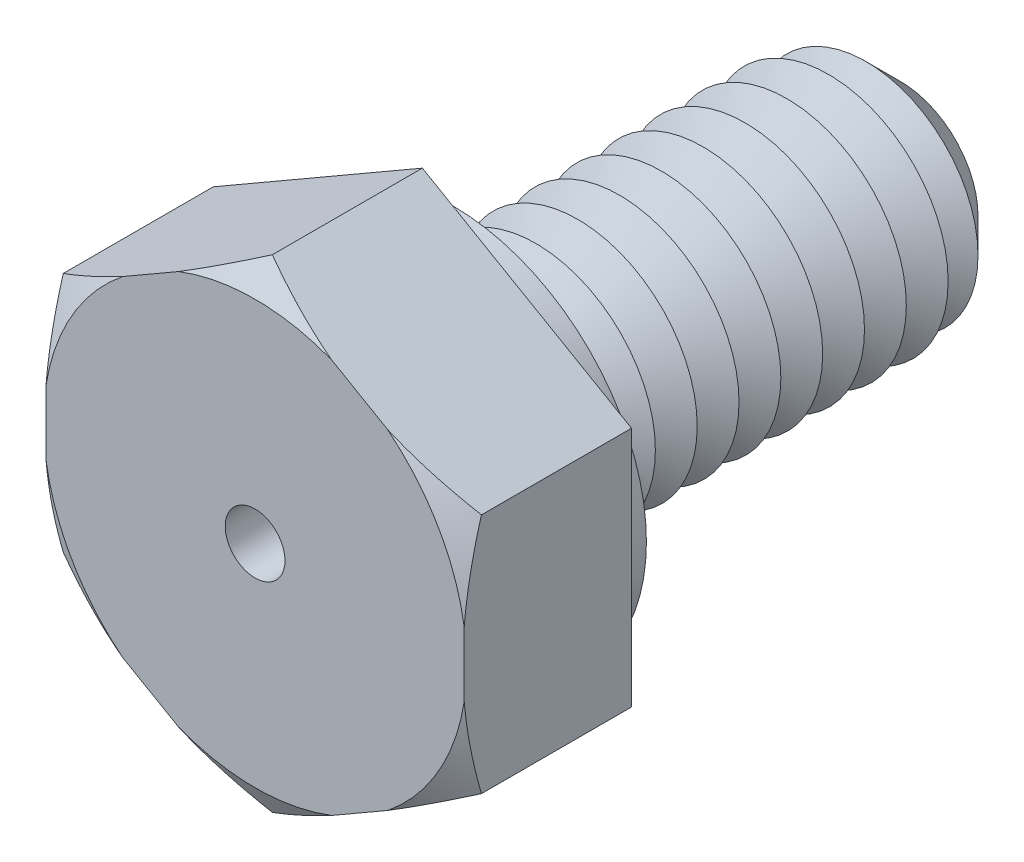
ISO-10303-21;
HEADER;
FILE_DESCRIPTION(('STEP AP214'),'2;1');
FILE_NAME('part.step','',(''),(''),'','','');
FILE_SCHEMA(('AUTOMOTIVE_DESIGN { 1 0 10303 214 1 1 1 1 }'));
ENDSEC;
DATA;
#1=APPLICATION_CONTEXT('core data for automotive mechanical design processes');
#2=APPLICATION_PROTOCOL_DEFINITION('international standard','automotive_design',2000,#1);
#3=PRODUCT_CONTEXT('',#1,'mechanical');
#4=PRODUCT('Part','Part','',(#3));
#5=PRODUCT_RELATED_PRODUCT_CATEGORY('part','',(#4));
#6=PRODUCT_DEFINITION_FORMATION('','',#4);
#7=PRODUCT_DEFINITION_CONTEXT('part definition',#1,'design');
#8=PRODUCT_DEFINITION('design','',#6,#7);
#9=PRODUCT_DEFINITION_SHAPE('','',#8);
#10=(LENGTH_UNIT() NAMED_UNIT(*) SI_UNIT(.MILLI.,.METRE.));
#11=(NAMED_UNIT(*) PLANE_ANGLE_UNIT() SI_UNIT($,.RADIAN.));
#12=(NAMED_UNIT(*) SI_UNIT($,.STERADIAN.) SOLID_ANGLE_UNIT());
#13=UNCERTAINTY_MEASURE_WITH_UNIT(LENGTH_MEASURE(1.E-05),#10,'distance_accuracy_value','');
#14=(GEOMETRIC_REPRESENTATION_CONTEXT(3) GLOBAL_UNCERTAINTY_ASSIGNED_CONTEXT((#13)) GLOBAL_UNIT_ASSIGNED_CONTEXT((#10,
#11,#12)) REPRESENTATION_CONTEXT('',''));
#15=CARTESIAN_POINT('',(0.,0.,0.));
#16=DIRECTION('',(0.,0.,1.));
#17=DIRECTION('',(1.,0.,0.));
#18=AXIS2_PLACEMENT_3D('',#15,#16,#17);
#19=CARTESIAN_POINT('',(3.5,2.02072594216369,2.8));
#20=DIRECTION('',(-0.5,-0.866025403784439,0.));
#21=DIRECTION('',(0.866025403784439,-0.5,0.));
#22=AXIS2_PLACEMENT_3D('',#19,#20,#21);
#23=PLANE('',#22);
#24=CARTESIAN_POINT('',(5.93124915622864,0.617043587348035,1.40176894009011));
#25=CARTESIAN_POINT('',(5.82127624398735,0.680536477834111,1.46111507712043));
#26=CARTESIAN_POINT('',(5.71104026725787,0.744181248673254,1.51982121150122));
#27=CARTESIAN_POINT('',(5.48993126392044,0.871838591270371,1.63565294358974));
#28=CARTESIAN_POINT('',(5.37905815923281,0.935851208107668,1.69277834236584));
#29=CARTESIAN_POINT('',(5.15623473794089,1.06449837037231,1.80531321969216));
#30=CARTESIAN_POINT('',(5.04428210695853,1.12913425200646,1.86071660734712));
#31=CARTESIAN_POINT('',(4.81953834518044,1.25889012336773,1.96920237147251));
#32=CARTESIAN_POINT('',(4.70674724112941,1.32401009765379,2.02228482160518));
#33=CARTESIAN_POINT('',(4.4773029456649,1.45647982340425,2.12693843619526));
#34=CARTESIAN_POINT('',(4.3606246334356,1.52384407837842,2.17843650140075));
#35=CARTESIAN_POINT('',(4.12610336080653,1.65924499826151,2.27776074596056));
#36=CARTESIAN_POINT('',(4.00826046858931,1.72728162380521,2.32558713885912));
#37=CARTESIAN_POINT('',(3.77136592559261,1.86405275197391,2.41666718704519));
#38=CARTESIAN_POINT('',(3.65231548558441,1.93278655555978,2.45992500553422));
#39=CARTESIAN_POINT('',(3.41281068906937,2.07106471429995,2.54086522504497));
#40=CARTESIAN_POINT('',(3.29235651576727,2.14060896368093,2.57854834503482));
#41=CARTESIAN_POINT('',(3.00433211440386,2.30689992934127,2.66006219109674));
#42=CARTESIAN_POINT('',(2.83610127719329,2.40402804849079,2.70086381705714));
#43=CARTESIAN_POINT('',(2.49725085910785,2.59966342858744,2.76622673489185));
#44=CARTESIAN_POINT('',(2.32663213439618,2.69817019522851,2.79079370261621));
#45=CARTESIAN_POINT('',(2.07079150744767,2.84587985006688,2.81342200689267));
#46=CARTESIAN_POINT('',(1.98601608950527,2.89482496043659,2.8186046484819));
#47=CARTESIAN_POINT('',(1.81634230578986,2.9927861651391,2.82423615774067));
#48=CARTESIAN_POINT('',(1.73144394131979,3.04180225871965,2.82468507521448));
#49=CARTESIAN_POINT('',(1.56172682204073,3.13978848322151,2.82082792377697));
#50=CARTESIAN_POINT('',(1.47690807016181,3.18875861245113,2.81652168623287));
#51=CARTESIAN_POINT('',(1.30753953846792,3.28654357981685,2.80328667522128));
#52=CARTESIAN_POINT('',(1.22298977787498,3.3353584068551,2.79435757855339));
#53=CARTESIAN_POINT('',(1.02330750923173,3.45064501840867,2.76803629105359));
#54=CARTESIAN_POINT('',(0.90836188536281,3.51700890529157,2.7487394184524));
#55=CARTESIAN_POINT('',(0.679569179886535,3.64910243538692,2.70286231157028));
#56=CARTESIAN_POINT('',(0.565722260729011,3.71483198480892,2.67628101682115));
#57=CARTESIAN_POINT('',(0.339141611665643,3.84564838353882,2.61683846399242));
#58=CARTESIAN_POINT('',(0.226409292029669,3.91073441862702,2.58397011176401));
#59=CARTESIAN_POINT('',(0.00220965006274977,4.04017614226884,2.512988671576));
#60=CARTESIAN_POINT('',(-0.109257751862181,4.10453187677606,2.47487591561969));
#61=CARTESIAN_POINT('',(-0.332327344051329,4.23332116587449,2.39383232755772));
#62=CARTESIAN_POINT('',(-0.443915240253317,4.29774646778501,2.35084938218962));
#63=CARTESIAN_POINT('',(-0.665905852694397,4.42591280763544,2.26126522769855));
#64=CARTESIAN_POINT('',(-0.776309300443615,4.48965426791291,2.2146664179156));
#65=CARTESIAN_POINT('',(-1.10600622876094,4.68000487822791,2.07044134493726));
#66=CARTESIAN_POINT('',(-1.32384189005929,4.80577235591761,1.96836549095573));
#67=CARTESIAN_POINT('',(-1.61545494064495,4.97413522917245,1.82536950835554));
#68=CARTESIAN_POINT('',(-1.69056073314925,5.01749757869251,1.78796601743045));
#69=CARTESIAN_POINT('',(-1.84044297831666,5.10403213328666,1.71229146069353));
#70=CARTESIAN_POINT('',(-1.91521944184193,5.14720434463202,1.67402042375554));
#71=CARTESIAN_POINT('',(-2.06368614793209,5.23292163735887,1.59712633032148));
#72=CARTESIAN_POINT('',(-2.13737951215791,5.27546852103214,1.55851128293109));
#73=CARTESIAN_POINT('',(-2.28450431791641,5.36041106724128,1.48061736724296));
#74=CARTESIAN_POINT('',(-2.35793575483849,5.40280672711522,1.44133848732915));
#75=CARTESIAN_POINT('',(-2.43124915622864,5.44513423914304,1.40176894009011));
#76=B_SPLINE_CURVE_WITH_KNOTS('',3,(#24,#25,#26,#27,#28,#29,#30,#31,#32,#33,#34,#35,#36,#37,#38,
#39,#40,#41,#42,#43,#44,#45,#46,#47,#48,#49,#50,#51,#52,#53,#54,#55,#56,#57,#58,#59,#60,#61,#62,
#63,#64,#65,#66,#67,#68,#69,#70,#71,#72,#73,#74,#75),.UNSPECIFIED.,.F.,.F.,(4,2,2,2,2,2,2,2,2,2,
2,2,2,2,2,2,2,2,2,2,2,2,2,2,2,4),(0.,0.420511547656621,0.841075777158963,1.26298883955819,
1.68488850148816,2.11755106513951,2.55018844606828,2.98242811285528,3.41461198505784,
4.0095520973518,4.60428410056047,4.89826759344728,5.19224799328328,5.48623881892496,
5.78025020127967,6.1823765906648,6.58456155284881,6.98720303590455,7.3898190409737,
7.7972442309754,8.20440134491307,9.01851321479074,9.30185450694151,9.58518638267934,
9.86552040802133,10.1458593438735),.UNSPECIFIED.);
#77=CARTESIAN_POINT('',(3.5,2.02072594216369,2.51132486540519));
#78=VERTEX_POINT('',#77);
#79=CARTESIAN_POINT('',(2.2178793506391,2.76095864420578,2.8));
#80=VERTEX_POINT('',#79);
#81=EDGE_CURVE('E132',#78,#80,#76,.T.);
#82=ORIENTED_EDGE('',*,*,#81,.F.);
#83=DIRECTION('',(0.,0.,-1.));
#84=VECTOR('',#83,1.);
#85=CARTESIAN_POINT('',(3.5,2.02072594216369,2.8));
#86=LINE('',#85,#84);
#87=CARTESIAN_POINT('',(3.5,2.02072594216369,0.));
#88=VERTEX_POINT('',#87);
#89=EDGE_CURVE('E144',#78,#88,#86,.T.);
#90=ORIENTED_EDGE('',*,*,#89,.T.);
#91=DIRECTION('',(-0.866025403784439,0.5,0.));
#92=VECTOR('',#91,1.);
#93=CARTESIAN_POINT('',(3.5,2.02072594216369,0.));
#94=LINE('',#93,#92);
#95=CARTESIAN_POINT('',(0.,4.04145188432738,0.));
#96=VERTEX_POINT('',#95);
#97=EDGE_CURVE('E281',#88,#96,#94,.T.);
#98=ORIENTED_EDGE('',*,*,#97,.T.);
#99=DIRECTION('',(0.,0.,-1.));
#100=VECTOR('',#99,1.);
#101=CARTESIAN_POINT('',(0.,4.04145188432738,2.8));
#102=LINE('',#101,#100);
#103=CARTESIAN_POINT('',(0.,4.04145188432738,2.51132486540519));
#104=VERTEX_POINT('',#103);
#105=EDGE_CURVE('E179',#104,#96,#102,.T.);
#106=ORIENTED_EDGE('',*,*,#105,.F.);
#107=CARTESIAN_POINT('',(1.2821206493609,3.30121918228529,2.8));
#108=VERTEX_POINT('',#107);
#109=EDGE_CURVE('E151',#108,#104,#76,.T.);
#110=ORIENTED_EDGE('',*,*,#109,.F.);
#111=DIRECTION('',(-0.866025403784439,0.5,0.));
#112=VECTOR('',#111,1.);
#113=CARTESIAN_POINT('',(3.5,2.02072594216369,2.8));
#114=LINE('',#113,#112);
#115=EDGE_CURVE('E148',#80,#108,#114,.T.);
#116=ORIENTED_EDGE('',*,*,#115,.F.);
#117=EDGE_LOOP('',(#82,#90,#98,#106,#110,#116));
#118=FACE_BOUND('',#117,.T.);
#119=ADVANCED_FACE('F39',(#118),#23,.F.);
#120=CARTESIAN_POINT('',(0.,4.04145188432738,2.8));
#121=DIRECTION('',(0.5,-0.866025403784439,0.));
#122=DIRECTION('',(0.866025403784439,0.5,0.));
#123=AXIS2_PLACEMENT_3D('',#120,#121,#122);
#124=PLANE('',#123);
#125=CARTESIAN_POINT('',(2.43124915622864,5.44513423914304,1.4017689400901));
#126=CARTESIAN_POINT('',(2.32127624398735,5.38164134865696,1.46111507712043));
#127=CARTESIAN_POINT('',(2.21104026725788,5.31799657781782,1.51982121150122));
#128=CARTESIAN_POINT('',(1.98993126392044,5.1903392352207,1.63565294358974));
#129=CARTESIAN_POINT('',(1.87905815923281,5.1263266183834,1.69277834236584));
#130=CARTESIAN_POINT('',(1.65623473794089,4.99767945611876,1.80531321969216));
#131=CARTESIAN_POINT('',(1.54428210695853,4.93304357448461,1.86071660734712));
#132=CARTESIAN_POINT('',(1.31953834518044,4.80328770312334,1.96920237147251));
#133=CARTESIAN_POINT('',(1.20674724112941,4.73816772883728,2.02228482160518));
#134=CARTESIAN_POINT('',(0.977302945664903,4.60569800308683,2.12693843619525));
#135=CARTESIAN_POINT('',(0.860624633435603,4.53833374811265,2.17843650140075));
#136=CARTESIAN_POINT('',(0.626103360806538,4.40293282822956,2.27776074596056));
#137=CARTESIAN_POINT('',(0.50826046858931,4.33489620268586,2.32558713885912));
#138=CARTESIAN_POINT('',(0.271365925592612,4.19812507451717,2.41666718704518));
#139=CARTESIAN_POINT('',(0.152315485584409,4.12939127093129,2.45992500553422));
#140=CARTESIAN_POINT('',(-0.0871893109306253,3.99111311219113,2.54086522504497));
#141=CARTESIAN_POINT('',(-0.207643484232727,3.92156886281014,2.57854834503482));
#142=CARTESIAN_POINT('',(-0.495667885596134,3.7552778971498,2.66006219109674));
#143=CARTESIAN_POINT('',(-0.663898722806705,3.65814977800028,2.70086381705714));
#144=CARTESIAN_POINT('',(-1.00274914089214,3.46251439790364,2.76622673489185));
#145=CARTESIAN_POINT('',(-1.17336786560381,3.36400763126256,2.79079370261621));
#146=CARTESIAN_POINT('',(-1.42920849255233,3.21629797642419,2.81342200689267));
#147=CARTESIAN_POINT('',(-1.51398391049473,3.16735286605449,2.8186046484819));
#148=CARTESIAN_POINT('',(-1.68365769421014,3.06939166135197,2.82423615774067));
#149=CARTESIAN_POINT('',(-1.7685560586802,3.02037556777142,2.82468507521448));
#150=CARTESIAN_POINT('',(-1.93827317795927,2.92238934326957,2.82082792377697));
#151=CARTESIAN_POINT('',(-2.02309192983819,2.87341921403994,2.81652168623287));
#152=CARTESIAN_POINT('',(-2.19246046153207,2.77563424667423,2.80328667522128));
#153=CARTESIAN_POINT('',(-2.27701022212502,2.72681941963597,2.79435757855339));
#154=CARTESIAN_POINT('',(-2.47669249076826,2.6115328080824,2.76803629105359));
#155=CARTESIAN_POINT('',(-2.59163811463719,2.54516892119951,2.7487394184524));
#156=CARTESIAN_POINT('',(-2.82043082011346,2.41307539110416,2.70286231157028));
#157=CARTESIAN_POINT('',(-2.93427773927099,2.34734584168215,2.67628101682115));
#158=CARTESIAN_POINT('',(-3.16085838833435,2.21652944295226,2.61683846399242));
#159=CARTESIAN_POINT('',(-3.27359070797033,2.15144340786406,2.58397011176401));
#160=CARTESIAN_POINT('',(-3.49779034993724,2.02200168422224,2.512988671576));
#161=CARTESIAN_POINT('',(-3.60925775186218,1.95764594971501,2.47487591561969));
#162=CARTESIAN_POINT('',(-3.83232734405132,1.82885666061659,2.39383232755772));
#163=CARTESIAN_POINT('',(-3.94391524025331,1.76443135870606,2.35084938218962));
#164=CARTESIAN_POINT('',(-4.16590585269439,1.63626501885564,2.26126522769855));
#165=CARTESIAN_POINT('',(-4.27630930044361,1.57252355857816,2.21466641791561));
#166=CARTESIAN_POINT('',(-4.60600622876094,1.38217294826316,2.07044134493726));
#167=CARTESIAN_POINT('',(-4.82384189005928,1.25640547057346,1.96836549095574));
#168=CARTESIAN_POINT('',(-5.11545494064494,1.08804259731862,1.82536950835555));
#169=CARTESIAN_POINT('',(-5.19056073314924,1.04468024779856,1.78796601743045));
#170=CARTESIAN_POINT('',(-5.34044297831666,0.958145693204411,1.71229146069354));
#171=CARTESIAN_POINT('',(-5.41521944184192,0.914973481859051,1.67402042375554));
#172=CARTESIAN_POINT('',(-5.56368614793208,0.829256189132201,1.59712633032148));
#173=CARTESIAN_POINT('',(-5.6373795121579,0.786709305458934,1.55851128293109));
#174=CARTESIAN_POINT('',(-5.78450431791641,0.701766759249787,1.48061736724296));
#175=CARTESIAN_POINT('',(-5.85793575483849,0.659371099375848,1.44133848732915));
#176=CARTESIAN_POINT('',(-5.93124915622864,0.617043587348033,1.40176894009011));
#177=B_SPLINE_CURVE_WITH_KNOTS('',3,(#125,#126,#127,#128,#129,#130,#131,#132,#133,#134,#135,
#136,#137,#138,#139,#140,#141,#142,#143,#144,#145,#146,#147,#148,#149,#150,#151,#152,#153,#154,
#155,#156,#157,#158,#159,#160,#161,#162,#163,#164,#165,#166,#167,#168,#169,#170,#171,#172,#173,
#174,#175,#176),.UNSPECIFIED.,.F.,.F.,(4,2,2,2,2,2,2,2,2,2,2,2,2,2,2,2,2,2,2,2,2,2,2,2,2,4),(0.,
0.420511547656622,0.841075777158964,1.26298883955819,1.68488850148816,2.11755106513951,
2.55018844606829,2.98242811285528,3.41461198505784,4.0095520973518,4.60428410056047,
4.89826759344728,5.19224799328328,5.48623881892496,5.78025020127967,6.1823765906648,
6.58456155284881,6.98720303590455,7.3898190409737,7.7972442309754,8.20440134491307,
9.01851321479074,9.30185450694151,9.58518638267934,9.86552040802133,10.1458593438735),.UNSPECIFIED.);
#178=CARTESIAN_POINT('',(-1.2821206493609,3.30121918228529,2.8));
#179=VERTEX_POINT('',#178);
#180=EDGE_CURVE('E798',#104,#179,#177,.T.);
#181=ORIENTED_EDGE('',*,*,#180,.F.);
#182=ORIENTED_EDGE('',*,*,#105,.T.);
#183=DIRECTION('',(-0.866025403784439,-0.5,0.));
#184=VECTOR('',#183,1.);
#185=CARTESIAN_POINT('',(0.,4.04145188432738,0.));
#186=LINE('',#185,#184);
#187=CARTESIAN_POINT('',(-3.5,2.02072594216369,0.));
#188=VERTEX_POINT('',#187);
#189=EDGE_CURVE('E301',#96,#188,#186,.T.);
#190=ORIENTED_EDGE('',*,*,#189,.T.);
#191=DIRECTION('',(0.,0.,-1.));
#192=VECTOR('',#191,1.);
#193=CARTESIAN_POINT('',(-3.5,2.02072594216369,2.8));
#194=LINE('',#193,#192);
#195=CARTESIAN_POINT('',(-3.5,2.02072594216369,2.51132486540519));
#196=VERTEX_POINT('',#195);
#197=EDGE_CURVE('E176',#196,#188,#194,.T.);
#198=ORIENTED_EDGE('',*,*,#197,.F.);
#199=CARTESIAN_POINT('',(-2.2178793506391,2.76095864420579,2.8));
#200=VERTEX_POINT('',#199);
#201=EDGE_CURVE('E382',#200,#196,#177,.T.);
#202=ORIENTED_EDGE('',*,*,#201,.F.);
#203=DIRECTION('',(-0.866025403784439,-0.5,0.));
#204=VECTOR('',#203,1.);
#205=CARTESIAN_POINT('',(0.,4.04145188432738,2.8));
#206=LINE('',#205,#204);
#207=EDGE_CURVE('E284',#179,#200,#206,.T.);
#208=ORIENTED_EDGE('',*,*,#207,.F.);
#209=EDGE_LOOP('',(#181,#182,#190,#198,#202,#208));
#210=FACE_BOUND('',#209,.T.);
#211=ADVANCED_FACE('F391',(#210),#124,.F.);
#212=CARTESIAN_POINT('',(-3.5,2.02072594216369,2.8));
#213=DIRECTION('',(1.,0.,0.));
#214=DIRECTION('',(0.,1.,0.));
#215=AXIS2_PLACEMENT_3D('',#212,#213,#214);
#216=PLANE('',#215);
#217=CARTESIAN_POINT('',(-3.5,4.45197509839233,1.57509745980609));
#218=CARTESIAN_POINT('',(-3.5,4.32552348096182,1.632476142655));
#219=CARTESIAN_POINT('',(-3.5,4.19872625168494,1.68910722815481));
#220=CARTESIAN_POINT('',(-3.5,3.94429210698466,1.80051165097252));
#221=CARTESIAN_POINT('',(-3.5,3.81665504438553,1.85528465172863));
#222=CARTESIAN_POINT('',(-3.5,3.55990351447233,1.96281335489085));
#223=CARTESIAN_POINT('',(-3.5,3.43078510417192,2.01555968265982));
#224=CARTESIAN_POINT('',(-3.5,3.17145843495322,2.11829034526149));
#225=CARTESIAN_POINT('',(-3.5,3.04125022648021,2.16827480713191));
#226=CARTESIAN_POINT('',(-3.5,2.78016103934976,2.26465408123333));
#227=CARTESIAN_POINT('',(-3.5,2.64928566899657,2.31106393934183));
#228=CARTESIAN_POINT('',(-3.5,2.38615329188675,2.39977727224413));
#229=CARTESIAN_POINT('',(-3.5,2.25389619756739,2.44208048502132));
#230=CARTESIAN_POINT('',(-3.5,1.85519063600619,2.56138283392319));
#231=CARTESIAN_POINT('',(-3.5,1.58637912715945,2.63093897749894));
#232=CARTESIAN_POINT('',(-3.5,1.11975855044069,2.72563856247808));
#233=CARTESIAN_POINT('',(-3.5,0.923391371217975,2.75778053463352));
#234=CARTESIAN_POINT('',(-3.5,0.528527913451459,2.80406409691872));
#235=CARTESIAN_POINT('',(-3.5,0.330032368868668,2.81821170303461));
#236=CARTESIAN_POINT('',(-3.5,-0.0672968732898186,2.82680706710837));
#237=CARTESIAN_POINT('',(-3.5,-0.266130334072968,2.82126532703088));
#238=CARTESIAN_POINT('',(-3.5,-0.662321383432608,2.79120496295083));
#239=CARTESIAN_POINT('',(-3.5,-0.859678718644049,2.76668315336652));
#240=CARTESIAN_POINT('',(-3.5,-1.34971804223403,2.68500356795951));
#241=CARTESIAN_POINT('',(-3.5,-1.64068160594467,2.61765497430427));
#242=CARTESIAN_POINT('',(-3.5,-2.07181303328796,2.497569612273));
#243=CARTESIAN_POINT('',(-3.5,-2.21482517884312,2.45429352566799));
#244=CARTESIAN_POINT('',(-3.5,-2.49919378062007,2.36258423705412));
#245=CARTESIAN_POINT('',(-3.5,-2.64055035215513,2.31415139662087));
#246=CARTESIAN_POINT('',(-3.5,-2.92337235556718,2.2125676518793));
#247=CARTESIAN_POINT('',(-3.5,-3.06482042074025,2.15936898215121));
#248=CARTESIAN_POINT('',(-3.5,-3.34639535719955,2.04956763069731));
#249=CARTESIAN_POINT('',(-3.5,-3.48652214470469,1.99296473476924));
#250=CARTESIAN_POINT('',(-3.5,-3.76476497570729,1.87738368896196));
#251=CARTESIAN_POINT('',(-3.5,-3.90288810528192,1.81842250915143));
#252=CARTESIAN_POINT('',(-3.5,-4.1781332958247,1.6982956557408));
#253=CARTESIAN_POINT('',(-3.5,-4.31525559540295,1.6371305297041));
#254=CARTESIAN_POINT('',(-3.5,-4.45197509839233,1.57509745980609));
#255=B_SPLINE_CURVE_WITH_KNOTS('',3,(#217,#218,#219,#220,#221,#222,#223,#224,#225,#226,#227,
#228,#229,#230,#231,#232,#233,#234,#235,#236,#237,#238,#239,#240,#241,#242,#243,#244,#245,#246,
#247,#248,#249,#250,#251,#252,#253,#254),.UNSPECIFIED.,.F.,.F.,(4,2,2,2,2,2,2,2,2,2,2,2,2,2,2,2,
2,2,4),(0.,0.416588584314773,0.83325222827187,1.251655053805,1.67003861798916,2.08655215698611,
2.50309225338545,3.3347974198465,3.93106101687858,4.52712521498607,5.12287153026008,
5.71871785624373,6.61272902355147,7.06093271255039,7.50910499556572,7.9624204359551,
8.41576442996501,8.86628772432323,9.31669984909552),.UNSPECIFIED.);
#256=CARTESIAN_POINT('',(-3.5,0.540260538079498,2.8));
#257=VERTEX_POINT('',#256);
#258=EDGE_CURVE('E381',#196,#257,#255,.T.);
#259=ORIENTED_EDGE('',*,*,#258,.F.);
#260=ORIENTED_EDGE('',*,*,#197,.T.);
#261=DIRECTION('',(0.,-1.,0.));
#262=VECTOR('',#261,1.);
#263=CARTESIAN_POINT('',(-3.5,2.02072594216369,0.));
#264=LINE('',#263,#262);
#265=CARTESIAN_POINT('',(-3.5,-2.02072594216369,0.));
#266=VERTEX_POINT('',#265);
#267=EDGE_CURVE('E305',#188,#266,#264,.T.);
#268=ORIENTED_EDGE('',*,*,#267,.T.);
#269=DIRECTION('',(0.,0.,-1.));
#270=VECTOR('',#269,1.);
#271=CARTESIAN_POINT('',(-3.5,-2.02072594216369,2.8));
#272=LINE('',#271,#270);
#273=CARTESIAN_POINT('',(-3.5,-2.02072594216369,2.51132486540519));
#274=VERTEX_POINT('',#273);
#275=EDGE_CURVE('E173',#274,#266,#272,.T.);
#276=ORIENTED_EDGE('',*,*,#275,.F.);
#277=CARTESIAN_POINT('',(-3.5,-0.540260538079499,2.8));
#278=VERTEX_POINT('',#277);
#279=EDGE_CURVE('E322',#278,#274,#255,.T.);
#280=ORIENTED_EDGE('',*,*,#279,.F.);
#281=DIRECTION('',(0.,-1.,0.));
#282=VECTOR('',#281,1.);
#283=CARTESIAN_POINT('',(-3.5,2.02072594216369,2.8));
#284=LINE('',#283,#282);
#285=EDGE_CURVE('E288',#257,#278,#284,.T.);
#286=ORIENTED_EDGE('',*,*,#285,.F.);
#287=EDGE_LOOP('',(#259,#260,#268,#276,#280,#286));
#288=FACE_BOUND('',#287,.T.);
#289=ADVANCED_FACE('F387',(#288),#216,.F.);
#290=CARTESIAN_POINT('',(-3.5,-2.02072594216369,2.8));
#291=DIRECTION('',(0.5,0.866025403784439,0.));
#292=DIRECTION('',(-0.866025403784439,0.5,0.));
#293=AXIS2_PLACEMENT_3D('',#290,#291,#292);
#294=PLANE('',#293);
#295=CARTESIAN_POINT('',(-5.93124915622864,-0.617043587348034,1.4017689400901));
#296=CARTESIAN_POINT('',(-5.82127624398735,-0.68053647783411,1.46111507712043));
#297=CARTESIAN_POINT('',(-5.71104026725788,-0.744181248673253,1.51982121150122));
#298=CARTESIAN_POINT('',(-5.48993126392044,-0.87183859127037,1.63565294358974));
#299=CARTESIAN_POINT('',(-5.37905815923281,-0.935851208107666,1.69277834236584));
#300=CARTESIAN_POINT('',(-5.15623473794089,-1.06449837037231,1.80531321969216));
#301=CARTESIAN_POINT('',(-5.04428210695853,-1.12913425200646,1.86071660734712));
#302=CARTESIAN_POINT('',(-4.81953834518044,-1.25889012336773,1.96920237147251));
#303=CARTESIAN_POINT('',(-4.70674724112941,-1.32401009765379,2.02228482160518));
#304=CARTESIAN_POINT('',(-4.4773029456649,-1.45647982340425,2.12693843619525));
#305=CARTESIAN_POINT('',(-4.3606246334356,-1.52384407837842,2.17843650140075));
#306=CARTESIAN_POINT('',(-4.12610336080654,-1.65924499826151,2.27776074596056));
#307=CARTESIAN_POINT('',(-4.00826046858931,-1.72728162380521,2.32558713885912));
#308=CARTESIAN_POINT('',(-3.77136592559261,-1.8640527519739,2.41666718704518));
#309=CARTESIAN_POINT('',(-3.65231548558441,-1.93278655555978,2.45992500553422));
#310=CARTESIAN_POINT('',(-3.41281068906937,-2.07106471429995,2.54086522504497));
#311=CARTESIAN_POINT('',(-3.29235651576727,-2.14060896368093,2.57854834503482));
#312=CARTESIAN_POINT('',(-3.00433211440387,-2.30689992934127,2.66006219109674));
#313=CARTESIAN_POINT('',(-2.83610127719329,-2.40402804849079,2.70086381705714));
#314=CARTESIAN_POINT('',(-2.49725085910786,-2.59966342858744,2.76622673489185));
#315=CARTESIAN_POINT('',(-2.32663213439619,-2.69817019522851,2.79079370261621));
#316=CARTESIAN_POINT('',(-2.07079150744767,-2.84587985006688,2.81342200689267));
#317=CARTESIAN_POINT('',(-1.98601608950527,-2.89482496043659,2.8186046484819));
#318=CARTESIAN_POINT('',(-1.81634230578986,-2.9927861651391,2.82423615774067));
#319=CARTESIAN_POINT('',(-1.7314439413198,-3.04180225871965,2.82468507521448));
#320=CARTESIAN_POINT('',(-1.56172682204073,-3.13978848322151,2.82082792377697));
#321=CARTESIAN_POINT('',(-1.47690807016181,-3.18875861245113,2.81652168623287));
#322=CARTESIAN_POINT('',(-1.30753953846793,-3.28654357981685,2.80328667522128));
#323=CARTESIAN_POINT('',(-1.22298977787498,-3.3353584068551,2.79435757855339));
#324=CARTESIAN_POINT('',(-1.02330750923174,-3.45064501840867,2.76803629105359));
#325=CARTESIAN_POINT('',(-0.908361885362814,-3.51700890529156,2.7487394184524));
#326=CARTESIAN_POINT('',(-0.679569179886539,-3.64910243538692,2.70286231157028));
#327=CARTESIAN_POINT('',(-0.565722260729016,-3.71483198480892,2.67628101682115));
#328=CARTESIAN_POINT('',(-0.339141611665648,-3.84564838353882,2.61683846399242));
#329=CARTESIAN_POINT('',(-0.226409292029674,-3.91073441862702,2.58397011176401));
#330=CARTESIAN_POINT('',(-0.00220965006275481,-4.04017614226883,2.512988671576));
#331=CARTESIAN_POINT('',(0.109257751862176,-4.10453187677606,2.47487591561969));
#332=CARTESIAN_POINT('',(0.332327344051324,-4.23332116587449,2.39383232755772));
#333=CARTESIAN_POINT('',(0.443915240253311,-4.29774646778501,2.35084938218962));
#334=CARTESIAN_POINT('',(0.665905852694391,-4.42591280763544,2.26126522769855));
#335=CARTESIAN_POINT('',(0.776309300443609,-4.48965426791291,2.2146664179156));
#336=CARTESIAN_POINT('',(1.10600622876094,-4.68000487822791,2.07044134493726));
#337=CARTESIAN_POINT('',(1.32384189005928,-4.80577235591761,1.96836549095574));
#338=CARTESIAN_POINT('',(1.61545494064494,-4.97413522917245,1.82536950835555));
#339=CARTESIAN_POINT('',(1.69056073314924,-5.01749757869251,1.78796601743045));
#340=CARTESIAN_POINT('',(1.84044297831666,-5.10403213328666,1.71229146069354));
#341=CARTESIAN_POINT('',(1.91521944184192,-5.14720434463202,1.67402042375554));
#342=CARTESIAN_POINT('',(2.06368614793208,-5.23292163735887,1.59712633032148));
#343=CARTESIAN_POINT('',(2.1373795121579,-5.27546852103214,1.55851128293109));
#344=CARTESIAN_POINT('',(2.28450431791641,-5.36041106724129,1.48061736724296));
#345=CARTESIAN_POINT('',(2.35793575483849,-5.40280672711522,1.44133848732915));
#346=CARTESIAN_POINT('',(2.43124915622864,-5.44513423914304,1.40176894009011));
#347=B_SPLINE_CURVE_WITH_KNOTS('',3,(#295,#296,#297,#298,#299,#300,#301,#302,#303,#304,#305,
#306,#307,#308,#309,#310,#311,#312,#313,#314,#315,#316,#317,#318,#319,#320,#321,#322,#323,#324,
#325,#326,#327,#328,#329,#330,#331,#332,#333,#334,#335,#336,#337,#338,#339,#340,#341,#342,#343,
#344,#345,#346),.UNSPECIFIED.,.F.,.F.,(4,2,2,2,2,2,2,2,2,2,2,2,2,2,2,2,2,2,2,2,2,2,2,2,2,4),(0.,
0.420511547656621,0.841075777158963,1.26298883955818,1.68488850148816,2.11755106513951,
2.55018844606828,2.98242811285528,3.41461198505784,4.00955209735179,4.60428410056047,
4.89826759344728,5.19224799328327,5.48623881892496,5.78025020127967,6.1823765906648,
6.58456155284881,6.98720303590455,7.38981904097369,7.7972442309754,8.20440134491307,
9.01851321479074,9.30185450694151,9.58518638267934,9.86552040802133,10.1458593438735),.UNSPECIFIED.);
#348=CARTESIAN_POINT('',(-2.2178793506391,-2.76095864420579,2.8));
#349=VERTEX_POINT('',#348);
#350=EDGE_CURVE('E321',#274,#349,#347,.T.);
#351=ORIENTED_EDGE('',*,*,#350,.F.);
#352=ORIENTED_EDGE('',*,*,#275,.T.);
#353=DIRECTION('',(0.866025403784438,-0.5,0.));
#354=VECTOR('',#353,1.);
#355=CARTESIAN_POINT('',(-3.5,-2.02072594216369,0.));
#356=LINE('',#355,#354);
#357=CARTESIAN_POINT('',(0.,-4.04145188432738,0.));
#358=VERTEX_POINT('',#357);
#359=EDGE_CURVE('E309',#266,#358,#356,.T.);
#360=ORIENTED_EDGE('',*,*,#359,.T.);
#361=DIRECTION('',(0.,0.,-1.));
#362=VECTOR('',#361,1.);
#363=CARTESIAN_POINT('',(0.,-4.04145188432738,2.8));
#364=LINE('',#363,#362);
#365=CARTESIAN_POINT('',(0.,-4.04145188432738,2.51132486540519));
#366=VERTEX_POINT('',#365);
#367=EDGE_CURVE('E163',#366,#358,#364,.T.);
#368=ORIENTED_EDGE('',*,*,#367,.F.);
#369=CARTESIAN_POINT('',(-1.2821206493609,-3.30121918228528,2.8));
#370=VERTEX_POINT('',#369);
#371=EDGE_CURVE('E323',#370,#366,#347,.T.);
#372=ORIENTED_EDGE('',*,*,#371,.F.);
#373=DIRECTION('',(0.866025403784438,-0.5,0.));
#374=VECTOR('',#373,1.);
#375=CARTESIAN_POINT('',(-3.5,-2.02072594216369,2.8));
#376=LINE('',#375,#374);
#377=EDGE_CURVE('E292',#349,#370,#376,.T.);
#378=ORIENTED_EDGE('',*,*,#377,.F.);
#379=EDGE_LOOP('',(#351,#352,#360,#368,#372,#378));
#380=FACE_BOUND('',#379,.T.);
#381=ADVANCED_FACE('F390',(#380),#294,.F.);
#382=CARTESIAN_POINT('',(0.,-4.04145188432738,2.8));
#383=DIRECTION('',(-0.5,0.866025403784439,0.));
#384=DIRECTION('',(-0.866025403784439,-0.5,0.));
#385=AXIS2_PLACEMENT_3D('',#382,#383,#384);
#386=PLANE('',#385);
#387=CARTESIAN_POINT('',(-2.43124915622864,-5.44513423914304,1.4017689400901));
#388=CARTESIAN_POINT('',(-2.32127624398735,-5.38164134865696,1.46111507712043));
#389=CARTESIAN_POINT('',(-2.21104026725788,-5.31799657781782,1.51982121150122));
#390=CARTESIAN_POINT('',(-1.98993126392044,-5.1903392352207,1.63565294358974));
#391=CARTESIAN_POINT('',(-1.87905815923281,-5.1263266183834,1.69277834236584));
#392=CARTESIAN_POINT('',(-1.65623473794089,-4.99767945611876,1.80531321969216));
#393=CARTESIAN_POINT('',(-1.54428210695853,-4.93304357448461,1.86071660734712));
#394=CARTESIAN_POINT('',(-1.31953834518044,-4.80328770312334,1.96920237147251));
#395=CARTESIAN_POINT('',(-1.20674724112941,-4.73816772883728,2.02228482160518));
#396=CARTESIAN_POINT('',(-0.977302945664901,-4.60569800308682,2.12693843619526));
#397=CARTESIAN_POINT('',(-0.860624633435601,-4.53833374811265,2.17843650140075));
#398=CARTESIAN_POINT('',(-0.626103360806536,-4.40293282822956,2.27776074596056));
#399=CARTESIAN_POINT('',(-0.508260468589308,-4.33489620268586,2.32558713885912));
#400=CARTESIAN_POINT('',(-0.27136592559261,-4.19812507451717,2.41666718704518));
#401=CARTESIAN_POINT('',(-0.152315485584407,-4.12939127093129,2.45992500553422));
#402=CARTESIAN_POINT('',(0.0871893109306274,-3.99111311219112,2.54086522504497));
#403=CARTESIAN_POINT('',(0.20764348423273,-3.92156886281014,2.57854834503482));
#404=CARTESIAN_POINT('',(0.495667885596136,-3.7552778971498,2.66006219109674));
#405=CARTESIAN_POINT('',(0.663898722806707,-3.65814977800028,2.70086381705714));
#406=CARTESIAN_POINT('',(1.00274914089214,-3.46251439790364,2.76622673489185));
#407=CARTESIAN_POINT('',(1.17336786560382,-3.36400763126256,2.79079370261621));
#408=CARTESIAN_POINT('',(1.42920849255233,-3.21629797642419,2.81342200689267));
#409=CARTESIAN_POINT('',(1.51398391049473,-3.16735286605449,2.8186046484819));
#410=CARTESIAN_POINT('',(1.68365769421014,-3.06939166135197,2.82423615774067));
#411=CARTESIAN_POINT('',(1.76855605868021,-3.02037556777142,2.82468507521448));
#412=CARTESIAN_POINT('',(1.93827317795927,-2.92238934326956,2.82082792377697));
#413=CARTESIAN_POINT('',(2.02309192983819,-2.87341921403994,2.81652168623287));
#414=CARTESIAN_POINT('',(2.19246046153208,-2.77563424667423,2.80328667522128));
#415=CARTESIAN_POINT('',(2.27701022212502,-2.72681941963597,2.79435757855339));
#416=CARTESIAN_POINT('',(2.47669249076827,-2.6115328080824,2.76803629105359));
#417=CARTESIAN_POINT('',(2.59163811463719,-2.54516892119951,2.7487394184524));
#418=CARTESIAN_POINT('',(2.82043082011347,-2.41307539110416,2.70286231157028));
#419=CARTESIAN_POINT('',(2.93427773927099,-2.34734584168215,2.67628101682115));
#420=CARTESIAN_POINT('',(3.16085838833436,-2.21652944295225,2.61683846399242));
#421=CARTESIAN_POINT('',(3.27359070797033,-2.15144340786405,2.58397011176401));
#422=CARTESIAN_POINT('',(3.49779034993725,-2.02200168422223,2.512988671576));
#423=CARTESIAN_POINT('',(3.60925775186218,-1.95764594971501,2.47487591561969));
#424=CARTESIAN_POINT('',(3.83232734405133,-1.82885666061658,2.39383232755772));
#425=CARTESIAN_POINT('',(3.94391524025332,-1.76443135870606,2.35084938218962));
#426=CARTESIAN_POINT('',(4.1659058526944,-1.63626501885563,2.26126522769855));
#427=CARTESIAN_POINT('',(4.27630930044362,-1.57252355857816,2.2146664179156));
#428=CARTESIAN_POINT('',(4.60600622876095,-1.38217294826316,2.07044134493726));
#429=CARTESIAN_POINT('',(4.82384189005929,-1.25640547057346,1.96836549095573));
#430=CARTESIAN_POINT('',(5.11545494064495,-1.08804259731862,1.82536950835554));
#431=CARTESIAN_POINT('',(5.19056073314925,-1.04468024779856,1.78796601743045));
#432=CARTESIAN_POINT('',(5.34044297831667,-0.95814569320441,1.71229146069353));
#433=CARTESIAN_POINT('',(5.41521944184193,-0.914973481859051,1.67402042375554));
#434=CARTESIAN_POINT('',(5.56368614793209,-0.829256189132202,1.59712633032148));
#435=CARTESIAN_POINT('',(5.63737951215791,-0.786709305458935,1.55851128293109));
#436=CARTESIAN_POINT('',(5.78450431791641,-0.70176675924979,1.48061736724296));
#437=CARTESIAN_POINT('',(5.85793575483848,-0.659371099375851,1.44133848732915));
#438=CARTESIAN_POINT('',(5.93124915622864,-0.617043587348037,1.40176894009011));
#439=B_SPLINE_CURVE_WITH_KNOTS('',3,(#387,#388,#389,#390,#391,#392,#393,#394,#395,#396,#397,
#398,#399,#400,#401,#402,#403,#404,#405,#406,#407,#408,#409,#410,#411,#412,#413,#414,#415,#416,
#417,#418,#419,#420,#421,#422,#423,#424,#425,#426,#427,#428,#429,#430,#431,#432,#433,#434,#435,
#436,#437,#438),.UNSPECIFIED.,.F.,.F.,(4,2,2,2,2,2,2,2,2,2,2,2,2,2,2,2,2,2,2,2,2,2,2,2,2,4),(0.,
0.420511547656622,0.841075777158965,1.26298883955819,1.68488850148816,2.11755106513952,
2.55018844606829,2.98242811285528,3.41461198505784,4.0095520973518,4.60428410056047,
4.89826759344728,5.19224799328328,5.48623881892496,5.78025020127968,6.18237659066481,
6.58456155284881,6.98720303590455,7.3898190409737,7.79724423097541,8.20440134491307,
9.01851321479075,9.30185450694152,9.58518638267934,9.86552040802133,10.1458593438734),.UNSPECIFIED.);
#440=CARTESIAN_POINT('',(1.2821206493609,-3.30121918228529,2.8));
#441=VERTEX_POINT('',#440);
#442=EDGE_CURVE('E64',#366,#441,#439,.T.);
#443=ORIENTED_EDGE('',*,*,#442,.F.);
#444=ORIENTED_EDGE('',*,*,#367,.T.);
#445=DIRECTION('',(0.866025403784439,0.5,0.));
#446=VECTOR('',#445,1.);
#447=CARTESIAN_POINT('',(0.,-4.04145188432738,0.));
#448=LINE('',#447,#446);
#449=CARTESIAN_POINT('',(3.5,-2.02072594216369,0.));
#450=VERTEX_POINT('',#449);
#451=EDGE_CURVE('E312',#358,#450,#448,.T.);
#452=ORIENTED_EDGE('',*,*,#451,.T.);
#453=DIRECTION('',(0.,0.,-1.));
#454=VECTOR('',#453,1.);
#455=CARTESIAN_POINT('',(3.5,-2.02072594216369,2.8));
#456=LINE('',#455,#454);
#457=CARTESIAN_POINT('',(3.5,-2.02072594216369,2.51132486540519));
#458=VERTEX_POINT('',#457);
#459=EDGE_CURVE('E157',#458,#450,#456,.T.);
#460=ORIENTED_EDGE('',*,*,#459,.F.);
#461=CARTESIAN_POINT('',(2.2178793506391,-2.76095864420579,2.8));
#462=VERTEX_POINT('',#461);
#463=EDGE_CURVE('E368',#462,#458,#439,.T.);
#464=ORIENTED_EDGE('',*,*,#463,.F.);
#465=DIRECTION('',(0.866025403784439,0.5,0.));
#466=VECTOR('',#465,1.);
#467=CARTESIAN_POINT('',(0.,-4.04145188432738,2.8));
#468=LINE('',#467,#466);
#469=EDGE_CURVE('E166',#441,#462,#468,.T.);
#470=ORIENTED_EDGE('',*,*,#469,.F.);
#471=EDGE_LOOP('',(#443,#444,#452,#460,#464,#470));
#472=FACE_BOUND('',#471,.T.);
#473=ADVANCED_FACE('F412',(#472),#386,.F.);
#474=CARTESIAN_POINT('',(3.5,-2.02072594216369,2.8));
#475=DIRECTION('',(-1.,0.,0.));
#476=DIRECTION('',(0.,-1.,0.));
#477=AXIS2_PLACEMENT_3D('',#474,#475,#476);
#478=PLANE('',#477);
#479=CARTESIAN_POINT('',(3.5,-4.45197509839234,1.57509745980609));
#480=CARTESIAN_POINT('',(3.5,-4.32552348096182,1.632476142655));
#481=CARTESIAN_POINT('',(3.5,-4.19872625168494,1.68910722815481));
#482=CARTESIAN_POINT('',(3.5,-3.94429210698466,1.80051165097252));
#483=CARTESIAN_POINT('',(3.5,-3.81665504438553,1.85528465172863));
#484=CARTESIAN_POINT('',(3.5,-3.55990351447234,1.96281335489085));
#485=CARTESIAN_POINT('',(3.5,-3.43078510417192,2.01555968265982));
#486=CARTESIAN_POINT('',(3.5,-3.17145843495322,2.11829034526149));
#487=CARTESIAN_POINT('',(3.5,-3.04125022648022,2.16827480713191));
#488=CARTESIAN_POINT('',(3.5,-2.78016103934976,2.26465408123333));
#489=CARTESIAN_POINT('',(3.5,-2.64928566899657,2.31106393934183));
#490=CARTESIAN_POINT('',(3.5,-2.38615329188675,2.39977727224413));
#491=CARTESIAN_POINT('',(3.5,-2.25389619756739,2.44208048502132));
#492=CARTESIAN_POINT('',(3.5,-1.85519063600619,2.56138283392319));
#493=CARTESIAN_POINT('',(3.5,-1.58637912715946,2.63093897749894));
#494=CARTESIAN_POINT('',(3.5,-1.11975855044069,2.72563856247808));
#495=CARTESIAN_POINT('',(3.5,-0.923391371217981,2.75778053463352));
#496=CARTESIAN_POINT('',(3.5,-0.528527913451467,2.80406409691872));
#497=CARTESIAN_POINT('',(3.5,-0.330032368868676,2.81821170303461));
#498=CARTESIAN_POINT('',(3.5,0.0672968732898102,2.82680706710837));
#499=CARTESIAN_POINT('',(3.5,0.26613033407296,2.82126532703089));
#500=CARTESIAN_POINT('',(3.5,0.662321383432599,2.79120496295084));
#501=CARTESIAN_POINT('',(3.5,0.85967871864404,2.76668315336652));
#502=CARTESIAN_POINT('',(3.5,1.34971804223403,2.68500356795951));
#503=CARTESIAN_POINT('',(3.5,1.64068160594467,2.61765497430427));
#504=CARTESIAN_POINT('',(3.5,2.07181303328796,2.497569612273));
#505=CARTESIAN_POINT('',(3.5,2.21482517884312,2.45429352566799));
#506=CARTESIAN_POINT('',(3.5,2.49919378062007,2.36258423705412));
#507=CARTESIAN_POINT('',(3.5,2.64055035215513,2.31415139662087));
#508=CARTESIAN_POINT('',(3.5,2.92337235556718,2.2125676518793));
#509=CARTESIAN_POINT('',(3.5,3.06482042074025,2.15936898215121));
#510=CARTESIAN_POINT('',(3.5,3.34639535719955,2.04956763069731));
#511=CARTESIAN_POINT('',(3.5,3.48652214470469,1.99296473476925));
#512=CARTESIAN_POINT('',(3.5,3.76476497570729,1.87738368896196));
#513=CARTESIAN_POINT('',(3.5,3.90288810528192,1.81842250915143));
#514=CARTESIAN_POINT('',(3.5,4.1781332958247,1.6982956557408));
#515=CARTESIAN_POINT('',(3.5,4.31525559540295,1.6371305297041));
#516=CARTESIAN_POINT('',(3.5,4.45197509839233,1.57509745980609));
#517=B_SPLINE_CURVE_WITH_KNOTS('',3,(#479,#480,#481,#482,#483,#484,#485,#486,#487,#488,#489,
#490,#491,#492,#493,#494,#495,#496,#497,#498,#499,#500,#501,#502,#503,#504,#505,#506,#507,#508,
#509,#510,#511,#512,#513,#514,#515,#516),.UNSPECIFIED.,.F.,.F.,(4,2,2,2,2,2,2,2,2,2,2,2,2,2,2,2,
2,2,4),(0.,0.416588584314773,0.83325222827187,1.251655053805,1.67003861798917,2.08655215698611,
2.50309225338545,3.33479741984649,3.93106101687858,4.52712521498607,5.12287153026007,
5.71871785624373,6.61272902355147,7.0609327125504,7.50910499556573,7.96242043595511,
8.41576442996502,8.86628772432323,9.31669984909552),.UNSPECIFIED.);
#518=CARTESIAN_POINT('',(3.5,-0.540260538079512,2.8));
#519=VERTEX_POINT('',#518);
#520=EDGE_CURVE('E56',#458,#519,#517,.T.);
#521=ORIENTED_EDGE('',*,*,#520,.F.);
#522=ORIENTED_EDGE('',*,*,#459,.T.);
#523=DIRECTION('',(0.,1.,0.));
#524=VECTOR('',#523,1.);
#525=CARTESIAN_POINT('',(3.5,-2.02072594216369,0.));
#526=LINE('',#525,#524);
#527=EDGE_CURVE('E154',#450,#88,#526,.T.);
#528=ORIENTED_EDGE('',*,*,#527,.T.);
#529=ORIENTED_EDGE('',*,*,#89,.F.);
#530=CARTESIAN_POINT('',(3.5,0.540260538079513,2.8));
#531=VERTEX_POINT('',#530);
#532=EDGE_CURVE('E129',#531,#78,#517,.T.);
#533=ORIENTED_EDGE('',*,*,#532,.F.);
#534=DIRECTION('',(0.,1.,0.));
#535=VECTOR('',#534,1.);
#536=CARTESIAN_POINT('',(3.5,-2.02072594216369,2.8));
#537=LINE('',#536,#535);
#538=EDGE_CURVE('E158',#519,#531,#537,.T.);
#539=ORIENTED_EDGE('',*,*,#538,.F.);
#540=EDGE_LOOP('',(#521,#522,#528,#529,#533,#539));
#541=FACE_BOUND('',#540,.T.);
#542=ADVANCED_FACE('F152',(#541),#478,.F.);
#543=CARTESIAN_POINT('',(0.,0.,2.8));
#544=DIRECTION('',(0.,0.,1.));
#545=DIRECTION('',(1.,0.,0.));
#546=AXIS2_PLACEMENT_3D('',#543,#544,#545);
#547=PLANE('',#546);
#548=CARTESIAN_POINT('',(0.,0.,2.8));
#549=DIRECTION('',(0.,0.,1.));
#550=DIRECTION('',(1.,0.,0.));
#551=AXIS2_PLACEMENT_3D('',#548,#549,#550);
#552=CIRCLE('',#551,0.5);
#553=CARTESIAN_POINT('',(0.5,0.,2.8));
#554=VERTEX_POINT('',#553);
#555=EDGE_CURVE('E334',#554,#554,#552,.T.);
#556=ORIENTED_EDGE('',*,*,#555,.F.);
#557=EDGE_LOOP('',(#556));
#558=FACE_BOUND('',#557,.T.);
#559=ORIENTED_EDGE('',*,*,#538,.T.);
#560=CARTESIAN_POINT('',(0.,0.,2.8));
#561=DIRECTION('',(0.,0.,1.));
#562=DIRECTION('',(1.,0.,0.));
#563=AXIS2_PLACEMENT_3D('',#560,#561,#562);
#564=CIRCLE('',#563,3.54145188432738);
#565=EDGE_CURVE('E134',#531,#80,#564,.T.);
#566=ORIENTED_EDGE('',*,*,#565,.T.);
#567=ORIENTED_EDGE('',*,*,#115,.T.);
#568=CARTESIAN_POINT('',(0.,0.,2.8));
#569=DIRECTION('',(0.,0.,1.));
#570=DIRECTION('',(1.,0.,0.));
#571=AXIS2_PLACEMENT_3D('',#568,#569,#570);
#572=CIRCLE('',#571,3.54145188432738);
#573=EDGE_CURVE('E11',#108,#179,#572,.T.);
#574=ORIENTED_EDGE('',*,*,#573,.T.);
#575=ORIENTED_EDGE('',*,*,#207,.T.);
#576=EDGE_CURVE('E49',#200,#257,#572,.T.);
#577=ORIENTED_EDGE('',*,*,#576,.T.);
#578=ORIENTED_EDGE('',*,*,#285,.T.);
#579=EDGE_CURVE('E329',#278,#349,#572,.T.);
#580=ORIENTED_EDGE('',*,*,#579,.T.);
#581=ORIENTED_EDGE('',*,*,#377,.T.);
#582=EDGE_CURVE('E331',#370,#441,#572,.T.);
#583=ORIENTED_EDGE('',*,*,#582,.T.);
#584=ORIENTED_EDGE('',*,*,#469,.T.);
#585=EDGE_CURVE('E43',#462,#519,#572,.T.);
#586=ORIENTED_EDGE('',*,*,#585,.T.);
#587=EDGE_LOOP('',(#559,#566,#567,#574,#575,#577,#578,#580,#581,#583,#584,#586));
#588=FACE_BOUND('',#587,.T.);
#589=ADVANCED_FACE('F422',(#558,#588),#547,.T.);
#590=CARTESIAN_POINT('',(0.,0.,0.));
#591=DIRECTION('',(0.,0.,1.));
#592=DIRECTION('',(1.,0.,0.));
#593=AXIS2_PLACEMENT_3D('',#590,#591,#592);
#594=PLANE('',#593);
#595=CARTESIAN_POINT('',(0.,0.,0.));
#596=DIRECTION('',(0.,0.,1.));
#597=DIRECTION('',(1.,0.,0.));
#598=AXIS2_PLACEMENT_3D('',#595,#596,#597);
#599=CIRCLE('',#598,3.25);
#600=CARTESIAN_POINT('',(3.25,0.,0.));
#601=VERTEX_POINT('',#600);
#602=EDGE_CURVE('E182',#601,#601,#599,.F.);
#603=ORIENTED_EDGE('',*,*,#602,.F.);
#604=EDGE_LOOP('',(#603));
#605=FACE_BOUND('',#604,.T.);
#606=ORIENTED_EDGE('',*,*,#97,.F.);
#607=ORIENTED_EDGE('',*,*,#527,.F.);
#608=ORIENTED_EDGE('',*,*,#451,.F.);
#609=ORIENTED_EDGE('',*,*,#359,.F.);
#610=ORIENTED_EDGE('',*,*,#267,.F.);
#611=ORIENTED_EDGE('',*,*,#189,.F.);
#612=EDGE_LOOP('',(#606,#607,#608,#609,#610,#611));
#613=FACE_BOUND('',#612,.T.);
#614=ADVANCED_FACE('F427',(#605,#613),#594,.F.);
#615=CARTESIAN_POINT('',(0.,0.,-0.5));
#616=DIRECTION('',(0.,0.,1.));
#617=DIRECTION('',(1.,0.,0.));
#618=AXIS2_PLACEMENT_3D('',#615,#616,#617);
#619=CYLINDRICAL_SURFACE('',#618,3.25);
#620=CARTESIAN_POINT('',(0.,0.,-0.5));
#621=DIRECTION('',(0.,0.,-1.));
#622=DIRECTION('',(-1.,0.,0.));
#623=AXIS2_PLACEMENT_3D('',#620,#621,#622);
#624=CIRCLE('',#623,3.25);
#625=CARTESIAN_POINT('',(-3.25,0.,-0.5));
#626=VERTEX_POINT('',#625);
#627=EDGE_CURVE('E277',#626,#626,#624,.T.);
#628=ORIENTED_EDGE('',*,*,#627,.F.);
#629=EDGE_LOOP('',(#628));
#630=FACE_BOUND('',#629,.T.);
#631=ORIENTED_EDGE('',*,*,#602,.T.);
#632=EDGE_LOOP('',(#631));
#633=FACE_BOUND('',#632,.T.);
#634=ADVANCED_FACE('F434',(#630,#633),#619,.T.);
#635=CARTESIAN_POINT('',(0.,0.,-0.5));
#636=DIRECTION('',(0.,0.,-1.));
#637=DIRECTION('',(-1.,0.,0.));
#638=AXIS2_PLACEMENT_3D('',#635,#636,#637);
#639=PLANE('',#638);
#640=CARTESIAN_POINT('',(0.,0.,-0.5));
#641=DIRECTION('',(0.,0.,1.));
#642=DIRECTION('',(1.,0.,0.));
#643=AXIS2_PLACEMENT_3D('',#640,#641,#642);
#644=CIRCLE('',#643,2.);
#645=CARTESIAN_POINT('',(2.,0.,-0.5));
#646=VERTEX_POINT('',#645);
#647=EDGE_CURVE('E273',#646,#646,#644,.T.);
#648=ORIENTED_EDGE('',*,*,#647,.T.);
#649=EDGE_LOOP('',(#648));
#650=FACE_BOUND('',#649,.T.);
#651=ORIENTED_EDGE('',*,*,#627,.T.);
#652=EDGE_LOOP('',(#651));
#653=FACE_BOUND('',#652,.T.);
#654=ADVANCED_FACE('F440',(#650,#653),#639,.T.);
#655=CARTESIAN_POINT('',(0.,0.,-0.5));
#656=DIRECTION('',(0.,0.,1.));
#657=DIRECTION('',(1.,0.,0.));
#658=AXIS2_PLACEMENT_3D('',#655,#656,#657);
#659=CONICAL_SURFACE('',#658,2.,1.0471975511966);
#660=CARTESIAN_POINT('',(0.,0.,-0.85));
#661=DIRECTION('',(0.,0.,1.));
#662=DIRECTION('',(1.,0.,0.));
#663=AXIS2_PLACEMENT_3D('',#660,#661,#662);
#664=CIRCLE('',#663,1.39378221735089);
#665=CARTESIAN_POINT('',(1.39378221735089,0.,-0.85));
#666=VERTEX_POINT('',#665);
#667=EDGE_CURVE('E269',#666,#666,#664,.T.);
#668=ORIENTED_EDGE('',*,*,#667,.T.);
#669=EDGE_LOOP('',(#668));
#670=FACE_BOUND('',#669,.T.);
#671=ORIENTED_EDGE('',*,*,#647,.F.);
#672=EDGE_LOOP('',(#671));
#673=FACE_BOUND('',#672,.T.);
#674=ADVANCED_FACE('F447',(#670,#673),#659,.T.);
#675=CARTESIAN_POINT('',(0.,0.,-0.85));
#676=DIRECTION('',(0.,0.,-1.));
#677=DIRECTION('',(-1.,0.,0.));
#678=AXIS2_PLACEMENT_3D('',#675,#676,#677);
#679=CONICAL_SURFACE('',#678,1.39378221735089,1.0471975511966);
#680=CARTESIAN_POINT('',(0.,0.,-1.2));
#681=DIRECTION('',(0.,0.,1.));
#682=DIRECTION('',(1.,0.,0.));
#683=AXIS2_PLACEMENT_3D('',#680,#681,#682);
#684=CIRCLE('',#683,2.);
#685=CARTESIAN_POINT('',(2.,0.,-1.2));
#686=VERTEX_POINT('',#685);
#687=EDGE_CURVE('E265',#686,#686,#684,.T.);
#688=ORIENTED_EDGE('',*,*,#687,.T.);
#689=EDGE_LOOP('',(#688));
#690=FACE_BOUND('',#689,.T.);
#691=ORIENTED_EDGE('',*,*,#667,.F.);
#692=EDGE_LOOP('',(#691));
#693=FACE_BOUND('',#692,.T.);
#694=ADVANCED_FACE('F454',(#690,#693),#679,.T.);
#695=CARTESIAN_POINT('',(0.,0.,-1.2));
#696=DIRECTION('',(0.,0.,1.));
#697=DIRECTION('',(1.,0.,0.));
#698=AXIS2_PLACEMENT_3D('',#695,#696,#697);
#699=CONICAL_SURFACE('',#698,2.,1.0471975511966);
#700=CARTESIAN_POINT('',(0.,0.,-1.55));
#701=DIRECTION('',(0.,0.,1.));
#702=DIRECTION('',(1.,0.,0.));
#703=AXIS2_PLACEMENT_3D('',#700,#701,#702);
#704=CIRCLE('',#703,1.39378221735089);
#705=CARTESIAN_POINT('',(1.39378221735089,0.,-1.55));
#706=VERTEX_POINT('',#705);
#707=EDGE_CURVE('E261',#706,#706,#704,.T.);
#708=ORIENTED_EDGE('',*,*,#707,.T.);
#709=EDGE_LOOP('',(#708));
#710=FACE_BOUND('',#709,.T.);
#711=ORIENTED_EDGE('',*,*,#687,.F.);
#712=EDGE_LOOP('',(#711));
#713=FACE_BOUND('',#712,.T.);
#714=ADVANCED_FACE('F461',(#710,#713),#699,.T.);
#715=CARTESIAN_POINT('',(0.,0.,-1.55));
#716=DIRECTION('',(0.,0.,-1.));
#717=DIRECTION('',(-1.,0.,0.));
#718=AXIS2_PLACEMENT_3D('',#715,#716,#717);
#719=CONICAL_SURFACE('',#718,1.39378221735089,1.0471975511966);
#720=CARTESIAN_POINT('',(0.,0.,-1.9));
#721=DIRECTION('',(0.,0.,1.));
#722=DIRECTION('',(1.,0.,0.));
#723=AXIS2_PLACEMENT_3D('',#720,#721,#722);
#724=CIRCLE('',#723,2.);
#725=CARTESIAN_POINT('',(2.,0.,-1.9));
#726=VERTEX_POINT('',#725);
#727=EDGE_CURVE('E257',#726,#726,#724,.T.);
#728=ORIENTED_EDGE('',*,*,#727,.T.);
#729=EDGE_LOOP('',(#728));
#730=FACE_BOUND('',#729,.T.);
#731=ORIENTED_EDGE('',*,*,#707,.F.);
#732=EDGE_LOOP('',(#731));
#733=FACE_BOUND('',#732,.T.);
#734=ADVANCED_FACE('F468',(#730,#733),#719,.T.);
#735=CARTESIAN_POINT('',(0.,0.,-1.9));
#736=DIRECTION('',(0.,0.,1.));
#737=DIRECTION('',(1.,0.,0.));
#738=AXIS2_PLACEMENT_3D('',#735,#736,#737);
#739=CONICAL_SURFACE('',#738,2.,1.0471975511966);
#740=CARTESIAN_POINT('',(0.,0.,-2.25));
#741=DIRECTION('',(0.,0.,1.));
#742=DIRECTION('',(1.,0.,0.));
#743=AXIS2_PLACEMENT_3D('',#740,#741,#742);
#744=CIRCLE('',#743,1.39378221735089);
#745=CARTESIAN_POINT('',(1.39378221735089,0.,-2.25));
#746=VERTEX_POINT('',#745);
#747=EDGE_CURVE('E253',#746,#746,#744,.T.);
#748=ORIENTED_EDGE('',*,*,#747,.T.);
#749=EDGE_LOOP('',(#748));
#750=FACE_BOUND('',#749,.T.);
#751=ORIENTED_EDGE('',*,*,#727,.F.);
#752=EDGE_LOOP('',(#751));
#753=FACE_BOUND('',#752,.T.);
#754=ADVANCED_FACE('F475',(#750,#753),#739,.T.);
#755=CARTESIAN_POINT('',(0.,0.,-2.25));
#756=DIRECTION('',(0.,0.,-1.));
#757=DIRECTION('',(-1.,0.,0.));
#758=AXIS2_PLACEMENT_3D('',#755,#756,#757);
#759=CONICAL_SURFACE('',#758,1.39378221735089,1.0471975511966);
#760=CARTESIAN_POINT('',(0.,0.,-2.6));
#761=DIRECTION('',(0.,0.,1.));
#762=DIRECTION('',(1.,0.,0.));
#763=AXIS2_PLACEMENT_3D('',#760,#761,#762);
#764=CIRCLE('',#763,2.);
#765=CARTESIAN_POINT('',(2.,0.,-2.6));
#766=VERTEX_POINT('',#765);
#767=EDGE_CURVE('E249',#766,#766,#764,.T.);
#768=ORIENTED_EDGE('',*,*,#767,.T.);
#769=EDGE_LOOP('',(#768));
#770=FACE_BOUND('',#769,.T.);
#771=ORIENTED_EDGE('',*,*,#747,.F.);
#772=EDGE_LOOP('',(#771));
#773=FACE_BOUND('',#772,.T.);
#774=ADVANCED_FACE('F482',(#770,#773),#759,.T.);
#775=CARTESIAN_POINT('',(0.,0.,-2.6));
#776=DIRECTION('',(0.,0.,1.));
#777=DIRECTION('',(1.,0.,0.));
#778=AXIS2_PLACEMENT_3D('',#775,#776,#777);
#779=CONICAL_SURFACE('',#778,2.,1.0471975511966);
#780=CARTESIAN_POINT('',(0.,0.,-2.95));
#781=DIRECTION('',(0.,0.,1.));
#782=DIRECTION('',(1.,0.,0.));
#783=AXIS2_PLACEMENT_3D('',#780,#781,#782);
#784=CIRCLE('',#783,1.39378221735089);
#785=CARTESIAN_POINT('',(1.39378221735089,0.,-2.95));
#786=VERTEX_POINT('',#785);
#787=EDGE_CURVE('E246',#786,#786,#784,.T.);
#788=ORIENTED_EDGE('',*,*,#787,.T.);
#789=EDGE_LOOP('',(#788));
#790=FACE_BOUND('',#789,.T.);
#791=ORIENTED_EDGE('',*,*,#767,.F.);
#792=EDGE_LOOP('',(#791));
#793=FACE_BOUND('',#792,.T.);
#794=ADVANCED_FACE('F489',(#790,#793),#779,.T.);
#795=CARTESIAN_POINT('',(0.,0.,-2.95));
#796=DIRECTION('',(0.,0.,-1.));
#797=DIRECTION('',(-1.,0.,0.));
#798=AXIS2_PLACEMENT_3D('',#795,#796,#797);
#799=CONICAL_SURFACE('',#798,1.39378221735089,1.0471975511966);
#800=CARTESIAN_POINT('',(0.,0.,-3.3));
#801=DIRECTION('',(0.,0.,1.));
#802=DIRECTION('',(1.,0.,0.));
#803=AXIS2_PLACEMENT_3D('',#800,#801,#802);
#804=CIRCLE('',#803,2.);
#805=CARTESIAN_POINT('',(2.,0.,-3.3));
#806=VERTEX_POINT('',#805);
#807=EDGE_CURVE('E242',#806,#806,#804,.T.);
#808=ORIENTED_EDGE('',*,*,#807,.T.);
#809=EDGE_LOOP('',(#808));
#810=FACE_BOUND('',#809,.T.);
#811=ORIENTED_EDGE('',*,*,#787,.F.);
#812=EDGE_LOOP('',(#811));
#813=FACE_BOUND('',#812,.T.);
#814=ADVANCED_FACE('F496',(#810,#813),#799,.T.);
#815=CARTESIAN_POINT('',(0.,0.,-3.3));
#816=DIRECTION('',(0.,0.,1.));
#817=DIRECTION('',(1.,0.,0.));
#818=AXIS2_PLACEMENT_3D('',#815,#816,#817);
#819=CONICAL_SURFACE('',#818,2.,1.0471975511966);
#820=CARTESIAN_POINT('',(0.,0.,-3.65));
#821=DIRECTION('',(0.,0.,1.));
#822=DIRECTION('',(1.,0.,0.));
#823=AXIS2_PLACEMENT_3D('',#820,#821,#822);
#824=CIRCLE('',#823,1.39378221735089);
#825=CARTESIAN_POINT('',(1.39378221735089,0.,-3.65));
#826=VERTEX_POINT('',#825);
#827=EDGE_CURVE('E238',#826,#826,#824,.T.);
#828=ORIENTED_EDGE('',*,*,#827,.T.);
#829=EDGE_LOOP('',(#828));
#830=FACE_BOUND('',#829,.T.);
#831=ORIENTED_EDGE('',*,*,#807,.F.);
#832=EDGE_LOOP('',(#831));
#833=FACE_BOUND('',#832,.T.);
#834=ADVANCED_FACE('F503',(#830,#833),#819,.T.);
#835=CARTESIAN_POINT('',(0.,0.,-3.65));
#836=DIRECTION('',(0.,0.,-1.));
#837=DIRECTION('',(-1.,0.,0.));
#838=AXIS2_PLACEMENT_3D('',#835,#836,#837);
#839=CONICAL_SURFACE('',#838,1.39378221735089,1.0471975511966);
#840=CARTESIAN_POINT('',(0.,0.,-4.));
#841=DIRECTION('',(0.,0.,1.));
#842=DIRECTION('',(1.,0.,0.));
#843=AXIS2_PLACEMENT_3D('',#840,#841,#842);
#844=CIRCLE('',#843,2.);
#845=CARTESIAN_POINT('',(2.,0.,-4.));
#846=VERTEX_POINT('',#845);
#847=EDGE_CURVE('E234',#846,#846,#844,.T.);
#848=ORIENTED_EDGE('',*,*,#847,.T.);
#849=EDGE_LOOP('',(#848));
#850=FACE_BOUND('',#849,.T.);
#851=ORIENTED_EDGE('',*,*,#827,.F.);
#852=EDGE_LOOP('',(#851));
#853=FACE_BOUND('',#852,.T.);
#854=ADVANCED_FACE('F510',(#850,#853),#839,.T.);
#855=CARTESIAN_POINT('',(0.,0.,-4.));
#856=DIRECTION('',(0.,0.,1.));
#857=DIRECTION('',(1.,0.,0.));
#858=AXIS2_PLACEMENT_3D('',#855,#856,#857);
#859=CONICAL_SURFACE('',#858,2.,1.0471975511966);
#860=CARTESIAN_POINT('',(0.,0.,-4.35));
#861=DIRECTION('',(0.,0.,1.));
#862=DIRECTION('',(1.,0.,0.));
#863=AXIS2_PLACEMENT_3D('',#860,#861,#862);
#864=CIRCLE('',#863,1.39378221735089);
#865=CARTESIAN_POINT('',(1.39378221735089,0.,-4.35));
#866=VERTEX_POINT('',#865);
#867=EDGE_CURVE('E230',#866,#866,#864,.T.);
#868=ORIENTED_EDGE('',*,*,#867,.T.);
#869=EDGE_LOOP('',(#868));
#870=FACE_BOUND('',#869,.T.);
#871=ORIENTED_EDGE('',*,*,#847,.F.);
#872=EDGE_LOOP('',(#871));
#873=FACE_BOUND('',#872,.T.);
#874=ADVANCED_FACE('F517',(#870,#873),#859,.T.);
#875=CARTESIAN_POINT('',(0.,0.,-4.35));
#876=DIRECTION('',(0.,0.,-1.));
#877=DIRECTION('',(-1.,0.,0.));
#878=AXIS2_PLACEMENT_3D('',#875,#876,#877);
#879=CONICAL_SURFACE('',#878,1.39378221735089,1.0471975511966);
#880=CARTESIAN_POINT('',(0.,0.,-4.7));
#881=DIRECTION('',(0.,0.,1.));
#882=DIRECTION('',(1.,0.,0.));
#883=AXIS2_PLACEMENT_3D('',#880,#881,#882);
#884=CIRCLE('',#883,2.);
#885=CARTESIAN_POINT('',(2.,0.,-4.7));
#886=VERTEX_POINT('',#885);
#887=EDGE_CURVE('E226',#886,#886,#884,.T.);
#888=ORIENTED_EDGE('',*,*,#887,.T.);
#889=EDGE_LOOP('',(#888));
#890=FACE_BOUND('',#889,.T.);
#891=ORIENTED_EDGE('',*,*,#867,.F.);
#892=EDGE_LOOP('',(#891));
#893=FACE_BOUND('',#892,.T.);
#894=ADVANCED_FACE('F524',(#890,#893),#879,.T.);
#895=CARTESIAN_POINT('',(0.,0.,-4.7));
#896=DIRECTION('',(0.,0.,1.));
#897=DIRECTION('',(1.,0.,0.));
#898=AXIS2_PLACEMENT_3D('',#895,#896,#897);
#899=CONICAL_SURFACE('',#898,2.,1.0471975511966);
#900=CARTESIAN_POINT('',(0.,0.,-5.05));
#901=DIRECTION('',(0.,0.,1.));
#902=DIRECTION('',(1.,0.,0.));
#903=AXIS2_PLACEMENT_3D('',#900,#901,#902);
#904=CIRCLE('',#903,1.39378221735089);
#905=CARTESIAN_POINT('',(1.39378221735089,0.,-5.05));
#906=VERTEX_POINT('',#905);
#907=EDGE_CURVE('E222',#906,#906,#904,.T.);
#908=ORIENTED_EDGE('',*,*,#907,.T.);
#909=EDGE_LOOP('',(#908));
#910=FACE_BOUND('',#909,.T.);
#911=ORIENTED_EDGE('',*,*,#887,.F.);
#912=EDGE_LOOP('',(#911));
#913=FACE_BOUND('',#912,.T.);
#914=ADVANCED_FACE('F531',(#910,#913),#899,.T.);
#915=CARTESIAN_POINT('',(0.,0.,-5.05));
#916=DIRECTION('',(0.,0.,-1.));
#917=DIRECTION('',(-1.,0.,0.));
#918=AXIS2_PLACEMENT_3D('',#915,#916,#917);
#919=CONICAL_SURFACE('',#918,1.39378221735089,1.0471975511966);
#920=CARTESIAN_POINT('',(0.,0.,-5.4));
#921=DIRECTION('',(0.,0.,1.));
#922=DIRECTION('',(1.,0.,0.));
#923=AXIS2_PLACEMENT_3D('',#920,#921,#922);
#924=CIRCLE('',#923,2.);
#925=CARTESIAN_POINT('',(2.,0.,-5.4));
#926=VERTEX_POINT('',#925);
#927=EDGE_CURVE('E218',#926,#926,#924,.T.);
#928=ORIENTED_EDGE('',*,*,#927,.T.);
#929=EDGE_LOOP('',(#928));
#930=FACE_BOUND('',#929,.T.);
#931=ORIENTED_EDGE('',*,*,#907,.F.);
#932=EDGE_LOOP('',(#931));
#933=FACE_BOUND('',#932,.T.);
#934=ADVANCED_FACE('F538',(#930,#933),#919,.T.);
#935=CARTESIAN_POINT('',(0.,0.,-5.4));
#936=DIRECTION('',(0.,0.,1.));
#937=DIRECTION('',(1.,0.,0.));
#938=AXIS2_PLACEMENT_3D('',#935,#936,#937);
#939=CONICAL_SURFACE('',#938,2.,1.0471975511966);
#940=CARTESIAN_POINT('',(0.,0.,-5.75));
#941=DIRECTION('',(0.,0.,1.));
#942=DIRECTION('',(1.,0.,0.));
#943=AXIS2_PLACEMENT_3D('',#940,#941,#942);
#944=CIRCLE('',#943,1.39378221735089);
#945=CARTESIAN_POINT('',(1.39378221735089,0.,-5.75));
#946=VERTEX_POINT('',#945);
#947=EDGE_CURVE('E214',#946,#946,#944,.T.);
#948=ORIENTED_EDGE('',*,*,#947,.T.);
#949=EDGE_LOOP('',(#948));
#950=FACE_BOUND('',#949,.T.);
#951=ORIENTED_EDGE('',*,*,#927,.F.);
#952=EDGE_LOOP('',(#951));
#953=FACE_BOUND('',#952,.T.);
#954=ADVANCED_FACE('F545',(#950,#953),#939,.T.);
#955=CARTESIAN_POINT('',(0.,0.,-5.75));
#956=DIRECTION('',(0.,0.,-1.));
#957=DIRECTION('',(-1.,0.,0.));
#958=AXIS2_PLACEMENT_3D('',#955,#956,#957);
#959=CONICAL_SURFACE('',#958,1.39378221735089,1.0471975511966);
#960=CARTESIAN_POINT('',(0.,0.,-6.1));
#961=DIRECTION('',(0.,0.,1.));
#962=DIRECTION('',(1.,0.,0.));
#963=AXIS2_PLACEMENT_3D('',#960,#961,#962);
#964=CIRCLE('',#963,2.);
#965=CARTESIAN_POINT('',(2.,0.,-6.1));
#966=VERTEX_POINT('',#965);
#967=EDGE_CURVE('E198',#966,#966,#964,.T.);
#968=ORIENTED_EDGE('',*,*,#967,.T.);
#969=EDGE_LOOP('',(#968));
#970=FACE_BOUND('',#969,.T.);
#971=ORIENTED_EDGE('',*,*,#947,.F.);
#972=EDGE_LOOP('',(#971));
#973=FACE_BOUND('',#972,.T.);
#974=ADVANCED_FACE('F552',(#970,#973),#959,.T.);
#975=CARTESIAN_POINT('',(0.,0.,-6.1));
#976=DIRECTION('',(0.,0.,1.));
#977=DIRECTION('',(1.,0.,0.));
#978=AXIS2_PLACEMENT_3D('',#975,#976,#977);
#979=CONICAL_SURFACE('',#978,2.,1.0471975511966);
#980=CARTESIAN_POINT('',(0.,0.,-6.45));
#981=DIRECTION('',(0.,0.,1.));
#982=DIRECTION('',(1.,0.,0.));
#983=AXIS2_PLACEMENT_3D('',#980,#981,#982);
#984=CIRCLE('',#983,1.39378221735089);
#985=CARTESIAN_POINT('',(1.39378221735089,0.,-6.45));
#986=VERTEX_POINT('',#985);
#987=EDGE_CURVE('E192',#986,#986,#984,.T.);
#988=ORIENTED_EDGE('',*,*,#987,.T.);
#989=EDGE_LOOP('',(#988));
#990=FACE_BOUND('',#989,.T.);
#991=ORIENTED_EDGE('',*,*,#967,.F.);
#992=EDGE_LOOP('',(#991));
#993=FACE_BOUND('',#992,.T.);
#994=ADVANCED_FACE('F559',(#990,#993),#979,.T.);
#995=CARTESIAN_POINT('',(0.,0.,-6.45));
#996=DIRECTION('',(0.,0.,-1.));
#997=DIRECTION('',(-1.,0.,0.));
#998=AXIS2_PLACEMENT_3D('',#995,#996,#997);
#999=CONICAL_SURFACE('',#998,1.39378221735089,1.0471975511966);
#1000=CARTESIAN_POINT('',(0.,0.,-6.8));
#1001=DIRECTION('',(0.,0.,1.));
#1002=DIRECTION('',(1.,0.,0.));
#1003=AXIS2_PLACEMENT_3D('',#1000,#1001,#1002);
#1004=CIRCLE('',#1003,2.);
#1005=CARTESIAN_POINT('',(2.,0.,-6.8));
#1006=VERTEX_POINT('',#1005);
#1007=EDGE_CURVE('E193',#1006,#1006,#1004,.T.);
#1008=ORIENTED_EDGE('',*,*,#1007,.T.);
#1009=EDGE_LOOP('',(#1008));
#1010=FACE_BOUND('',#1009,.T.);
#1011=ORIENTED_EDGE('',*,*,#987,.F.);
#1012=EDGE_LOOP('',(#1011));
#1013=FACE_BOUND('',#1012,.T.);
#1014=ADVANCED_FACE('F566',(#1010,#1013),#999,.T.);
#1015=CARTESIAN_POINT('',(0.,0.,-6.8));
#1016=DIRECTION('',(0.,0.,1.));
#1017=DIRECTION('',(1.,0.,0.));
#1018=AXIS2_PLACEMENT_3D('',#1015,#1016,#1017);
#1019=CONICAL_SURFACE('',#1018,2.,1.0471975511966);
#1020=CARTESIAN_POINT('',(0.,0.,-7.15));
#1021=DIRECTION('',(0.,0.,1.));
#1022=DIRECTION('',(1.,0.,0.));
#1023=AXIS2_PLACEMENT_3D('',#1020,#1021,#1022);
#1024=CIRCLE('',#1023,1.39378221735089);
#1025=CARTESIAN_POINT('',(1.39378221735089,0.,-7.15));
#1026=VERTEX_POINT('',#1025);
#1027=EDGE_CURVE('E202',#1026,#1026,#1024,.T.);
#1028=ORIENTED_EDGE('',*,*,#1027,.T.);
#1029=EDGE_LOOP('',(#1028));
#1030=FACE_BOUND('',#1029,.T.);
#1031=ORIENTED_EDGE('',*,*,#1007,.F.);
#1032=EDGE_LOOP('',(#1031));
#1033=FACE_BOUND('',#1032,.T.);
#1034=ADVANCED_FACE('F573',(#1030,#1033),#1019,.T.);
#1035=CARTESIAN_POINT('',(0.,0.,-7.15));
#1036=DIRECTION('',(0.,0.,-1.));
#1037=DIRECTION('',(-1.,0.,0.));
#1038=AXIS2_PLACEMENT_3D('',#1035,#1036,#1037);
#1039=CONICAL_SURFACE('',#1038,1.39378221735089,1.0471975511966);
#1040=CARTESIAN_POINT('',(0.,0.,-7.42679491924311));
#1041=DIRECTION('',(0.,0.,-1.));
#1042=DIRECTION('',(-1.,0.,0.));
#1043=AXIS2_PLACEMENT_3D('',#1040,#1041,#1042);
#1044=CIRCLE('',#1043,1.87320508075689);
#1045=CARTESIAN_POINT('',(1.87320508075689,0.,-7.42679491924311));
#1046=VERTEX_POINT('',#1045);
#1047=EDGE_CURVE('E189',#1046,#1046,#1044,.T.);
#1048=ORIENTED_EDGE('',*,*,#1047,.F.);
#1049=EDGE_LOOP('',(#1048));
#1050=FACE_BOUND('',#1049,.T.);
#1051=ORIENTED_EDGE('',*,*,#1027,.F.);
#1052=EDGE_LOOP('',(#1051));
#1053=FACE_BOUND('',#1052,.T.);
#1054=ADVANCED_FACE('F361',(#1050,#1053),#1039,.T.);
#1055=CARTESIAN_POINT('',(0.,0.,-8.));
#1056=DIRECTION('',(0.,0.,-1.));
#1057=DIRECTION('',(-1.,0.,0.));
#1058=AXIS2_PLACEMENT_3D('',#1055,#1056,#1057);
#1059=PLANE('',#1058);
#1060=CARTESIAN_POINT('',(0.,0.,-8.));
#1061=DIRECTION('',(0.,0.,-1.));
#1062=DIRECTION('',(-1.,0.,0.));
#1063=AXIS2_PLACEMENT_3D('',#1060,#1061,#1062);
#1064=CIRCLE('',#1063,0.5);
#1065=CARTESIAN_POINT('',(-0.5,0.,-8.));
#1066=VERTEX_POINT('',#1065);
#1067=EDGE_CURVE('E327',#1066,#1066,#1064,.F.);
#1068=ORIENTED_EDGE('',*,*,#1067,.T.);
#1069=EDGE_LOOP('',(#1068));
#1070=FACE_BOUND('',#1069,.T.);
#1071=CARTESIAN_POINT('',(0.,0.,-8.));
#1072=DIRECTION('',(0.,0.,-1.));
#1073=DIRECTION('',(-1.,0.,0.));
#1074=AXIS2_PLACEMENT_3D('',#1071,#1072,#1073);
#1075=CIRCLE('',#1074,1.3);
#1076=CARTESIAN_POINT('',(1.30000000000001,0.,-8.));
#1077=VERTEX_POINT('',#1076);
#1078=EDGE_CURVE('E186',#1077,#1077,#1075,.T.);
#1079=ORIENTED_EDGE('',*,*,#1078,.T.);
#1080=EDGE_LOOP('',(#1079));
#1081=FACE_BOUND('',#1080,.T.);
#1082=ADVANCED_FACE('F584',(#1070,#1081),#1059,.T.);
#1083=CARTESIAN_POINT('',(0.,0.,-8.));
#1084=DIRECTION('',(0.,0.,1.));
#1085=DIRECTION('',(1.,0.,0.));
#1086=AXIS2_PLACEMENT_3D('',#1083,#1084,#1085);
#1087=CONICAL_SURFACE('',#1086,1.3,0.785398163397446);
#1088=CARTESIAN_POINT('',(1.30000000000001,0.,-8.));
#1089=CARTESIAN_POINT('',(1.30597088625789,0.,-7.99402911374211));
#1090=CARTESIAN_POINT('',(1.31194177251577,0.,-7.98805822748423));
#1091=CARTESIAN_POINT('',(1.32388354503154,0.,-7.97611645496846));
#1092=CARTESIAN_POINT('',(1.32985443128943,0.,-7.97014556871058));
#1093=CARTESIAN_POINT('',(1.34179620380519,0.,-7.95820379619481));
#1094=CARTESIAN_POINT('',(1.34776709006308,0.,-7.95223290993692));
#1095=CARTESIAN_POINT('',(1.35970886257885,0.,-7.94029113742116));
#1096=CARTESIAN_POINT('',(1.36567974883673,0.,-7.93432025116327));
#1097=CARTESIAN_POINT('',(1.3776215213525,0.,-7.9223784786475));
#1098=CARTESIAN_POINT('',(1.38359240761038,0.,-7.91640759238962));
#1099=CARTESIAN_POINT('',(1.39553418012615,0.,-7.90446581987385));
#1100=CARTESIAN_POINT('',(1.40150506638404,0.,-7.89849493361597));
#1101=CARTESIAN_POINT('',(1.4134468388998,0.,-7.8865531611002));
#1102=CARTESIAN_POINT('',(1.41941772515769,0.,-7.88058227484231));
#1103=CARTESIAN_POINT('',(1.43135949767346,0.,-7.86864050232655));
#1104=CARTESIAN_POINT('',(1.43733038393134,0.,-7.86266961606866));
#1105=CARTESIAN_POINT('',(1.44927215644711,0.,-7.85072784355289));
#1106=CARTESIAN_POINT('',(1.45524304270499,0.,-7.84475695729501));
#1107=CARTESIAN_POINT('',(1.46718481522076,0.,-7.83281518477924));
#1108=CARTESIAN_POINT('',(1.47315570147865,0.,-7.82684429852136));
#1109=CARTESIAN_POINT('',(1.48509747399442,0.,-7.81490252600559));
#1110=CARTESIAN_POINT('',(1.4910683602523,0.,-7.8089316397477));
#1111=CARTESIAN_POINT('',(1.50301013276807,0.,-7.79698986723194));
#1112=CARTESIAN_POINT('',(1.50898101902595,0.,-7.79101898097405));
#1113=CARTESIAN_POINT('',(1.52092279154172,0.,-7.77907720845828));
#1114=CARTESIAN_POINT('',(1.5268936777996,0.,-7.7731063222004));
#1115=CARTESIAN_POINT('',(1.53883545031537,0.,-7.76116454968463));
#1116=CARTESIAN_POINT('',(1.54480633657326,0.,-7.75519366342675));
#1117=CARTESIAN_POINT('',(1.55674810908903,0.,-7.74325189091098));
#1118=CARTESIAN_POINT('',(1.56271899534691,0.,-7.73728100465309));
#1119=CARTESIAN_POINT('',(1.57466076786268,0.,-7.72533923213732));
#1120=CARTESIAN_POINT('',(1.58063165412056,0.,-7.71936834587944));
#1121=CARTESIAN_POINT('',(1.59257342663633,0.,-7.70742657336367));
#1122=CARTESIAN_POINT('',(1.59854431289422,0.,-7.70145568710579));
#1123=CARTESIAN_POINT('',(1.61048608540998,0.,-7.68951391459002));
#1124=CARTESIAN_POINT('',(1.61645697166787,0.,-7.68354302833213));
#1125=CARTESIAN_POINT('',(1.62839874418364,0.,-7.67160125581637));
#1126=CARTESIAN_POINT('',(1.63436963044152,0.,-7.66563036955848));
#1127=CARTESIAN_POINT('',(1.64631140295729,0.,-7.65368859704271));
#1128=CARTESIAN_POINT('',(1.65228228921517,0.,-7.64771771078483));
#1129=CARTESIAN_POINT('',(1.66422406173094,0.,-7.63577593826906));
#1130=CARTESIAN_POINT('',(1.67019494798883,0.,-7.62980505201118));
#1131=CARTESIAN_POINT('',(1.68213672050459,0.,-7.61786327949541));
#1132=CARTESIAN_POINT('',(1.68810760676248,0.,-7.61189239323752));
#1133=CARTESIAN_POINT('',(1.70004937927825,0.,-7.59995062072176));
#1134=CARTESIAN_POINT('',(1.70602026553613,0.,-7.59397973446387));
#1135=CARTESIAN_POINT('',(1.7179620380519,0.,-7.5820379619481));
#1136=CARTESIAN_POINT('',(1.72393292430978,0.,-7.57606707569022));
#1137=CARTESIAN_POINT('',(1.73587469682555,0.,-7.56412530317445));
#1138=CARTESIAN_POINT('',(1.74184558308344,0.,-7.55815441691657));
#1139=CARTESIAN_POINT('',(1.7537873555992,0.,-7.5462126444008));
#1140=CARTESIAN_POINT('',(1.75975824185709,0.,-7.54024175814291));
#1141=CARTESIAN_POINT('',(1.77170001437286,0.,-7.52829998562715));
#1142=CARTESIAN_POINT('',(1.77767090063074,0.,-7.52232909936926));
#1143=CARTESIAN_POINT('',(1.78961267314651,0.,-7.51038732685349));
#1144=CARTESIAN_POINT('',(1.79558355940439,0.,-7.50441644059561));
#1145=CARTESIAN_POINT('',(1.80752533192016,0.,-7.49247466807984));
#1146=CARTESIAN_POINT('',(1.81349621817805,0.,-7.48650378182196));
#1147=CARTESIAN_POINT('',(1.82543799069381,0.,-7.47456200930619));
#1148=CARTESIAN_POINT('',(1.8314088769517,0.,-7.4685911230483));
#1149=CARTESIAN_POINT('',(1.84335064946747,0.,-7.45664935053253));
#1150=CARTESIAN_POINT('',(1.84932153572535,0.,-7.45067846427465));
#1151=CARTESIAN_POINT('',(1.86126330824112,0.,-7.43873669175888));
#1152=CARTESIAN_POINT('',(1.867234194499,0.,-7.432765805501));
#1153=CARTESIAN_POINT('',(1.87320508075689,0.,-7.42679491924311));
#1154=B_SPLINE_CURVE_WITH_KNOTS('',3,(#1088,#1089,#1090,#1091,#1092,#1093,#1094,#1095,#1096,
#1097,#1098,#1099,#1100,#1101,#1102,#1103,#1104,#1105,#1106,#1107,#1108,#1109,#1110,#1111,#1112,
#1113,#1114,#1115,#1116,#1117,#1118,#1119,#1120,#1121,#1122,#1123,#1124,#1125,#1126,#1127,#1128,
#1129,#1130,#1131,#1132,#1133,#1134,#1135,#1136,#1137,#1138,#1139,#1140,#1141,#1142,#1143,#1144,
#1145,#1146,#1147,#1148,#1149,#1150,#1151,#1152,#1153),.UNSPECIFIED.,.F.,.F.,(4,2,2,2,2,2,2,2,2,
2,2,2,2,2,2,2,2,2,2,2,2,2,2,2,2,2,2,2,2,2,2,2,4),(0.,0.0253323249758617,0.0506646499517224,
0.0759969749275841,0.101329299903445,0.126661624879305,0.151993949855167,0.177326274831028,
0.202658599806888,0.22799092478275,0.253323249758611,0.278655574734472,0.303987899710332,
0.329320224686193,0.354652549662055,0.379984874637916,0.405317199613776,0.430649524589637,
0.455981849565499,0.481314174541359,0.50664649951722,0.531978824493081,0.557311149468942,
0.582643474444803,0.607975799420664,0.633308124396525,0.658640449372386,0.683972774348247,
0.709305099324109,0.734637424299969,0.75996974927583,0.785302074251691,0.810634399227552),.UNSPECIFIED.);
#1155=EDGE_CURVE('BSEAM41',#1077,#1046,#1154,.T.);
#1156=ORIENTED_EDGE('',*,*,#1078,.F.);
#1157=ORIENTED_EDGE('',*,*,#1047,.T.);
#1158=ORIENTED_EDGE('',*,*,#1155,.T.);
#1159=ORIENTED_EDGE('',*,*,#1155,.F.);
#1160=EDGE_LOOP('',(#1156,#1158,#1157,#1159));
#1161=FACE_BOUND('',#1160,.T.);
#1162=ADVANCED_FACE('F41',(#1161),#1087,.T.);
#1163=CARTESIAN_POINT('',(0.,0.,2.8));
#1164=DIRECTION('',(0.,0.,-1.));
#1165=DIRECTION('',(-1.,0.,0.));
#1166=AXIS2_PLACEMENT_3D('',#1163,#1164,#1165);
#1167=CONICAL_SURFACE('',#1166,3.54145188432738,1.0471975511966);
#1168=ORIENTED_EDGE('',*,*,#463,.T.);
#1169=ORIENTED_EDGE('',*,*,#520,.T.);
#1170=ORIENTED_EDGE('',*,*,#585,.F.);
#1171=EDGE_LOOP('',(#1168,#1169,#1170));
#1172=FACE_BOUND('',#1171,.T.);
#1173=ADVANCED_FACE('F595',(#1172),#1167,.T.);
#1174=ORIENTED_EDGE('',*,*,#371,.T.);
#1175=ORIENTED_EDGE('',*,*,#442,.T.);
#1176=ORIENTED_EDGE('',*,*,#582,.F.);
#1177=EDGE_LOOP('',(#1174,#1175,#1176));
#1178=FACE_BOUND('',#1177,.T.);
#1179=ADVANCED_FACE('F601',(#1178),#1167,.T.);
#1180=ORIENTED_EDGE('',*,*,#279,.T.);
#1181=ORIENTED_EDGE('',*,*,#350,.T.);
#1182=ORIENTED_EDGE('',*,*,#579,.F.);
#1183=EDGE_LOOP('',(#1180,#1181,#1182));
#1184=FACE_BOUND('',#1183,.T.);
#1185=ADVANCED_FACE('F606',(#1184),#1167,.T.);
#1186=ORIENTED_EDGE('',*,*,#201,.T.);
#1187=ORIENTED_EDGE('',*,*,#258,.T.);
#1188=ORIENTED_EDGE('',*,*,#576,.F.);
#1189=EDGE_LOOP('',(#1186,#1187,#1188));
#1190=FACE_BOUND('',#1189,.T.);
#1191=ADVANCED_FACE('F358',(#1190),#1167,.T.);
#1192=ORIENTED_EDGE('',*,*,#109,.T.);
#1193=ORIENTED_EDGE('',*,*,#180,.T.);
#1194=ORIENTED_EDGE('',*,*,#573,.F.);
#1195=EDGE_LOOP('',(#1192,#1193,#1194));
#1196=FACE_BOUND('',#1195,.T.);
#1197=ADVANCED_FACE('F353',(#1196),#1167,.T.);
#1198=ORIENTED_EDGE('',*,*,#81,.T.);
#1199=ORIENTED_EDGE('',*,*,#565,.F.);
#1200=ORIENTED_EDGE('',*,*,#532,.T.);
#1201=EDGE_LOOP('',(#1198,#1199,#1200));
#1202=FACE_BOUND('',#1201,.T.);
#1203=ADVANCED_FACE('F131',(#1202),#1167,.T.);
#1204=CARTESIAN_POINT('',(0.,0.,-9.41421356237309));
#1205=DIRECTION('',(0.,0.,1.));
#1206=DIRECTION('',(1.,0.,0.));
#1207=AXIS2_PLACEMENT_3D('',#1204,#1205,#1206);
#1208=CYLINDRICAL_SURFACE('',#1207,0.5);
#1209=ORIENTED_EDGE('',*,*,#555,.T.);
#1210=EDGE_LOOP('',(#1209));
#1211=FACE_BOUND('',#1210,.T.);
#1212=ORIENTED_EDGE('',*,*,#1067,.F.);
#1213=EDGE_LOOP('',(#1212));
#1214=FACE_BOUND('',#1213,.T.);
#1215=ADVANCED_FACE('F360',(#1211,#1214),#1208,.F.);
#1216=CLOSED_SHELL('',(#119,#211,#289,#381,#473,#542,#589,#614,#634,#654,#674,#694,#714,#734,
#754,#774,#794,#814,#834,#854,#874,#894,#914,#934,#954,#974,#994,#1014,#1034,#1054,#1082,#1162,
#1173,#1179,#1185,#1191,#1197,#1203,#1215));
#1217=MANIFOLD_SOLID_BREP('B2',#1216);
#1218=ADVANCED_BREP_SHAPE_REPRESENTATION('',(#18,#1217),#14);
#1219=SHAPE_DEFINITION_REPRESENTATION(#9,#1218);
ENDSEC;
END-ISO-10303-21;
